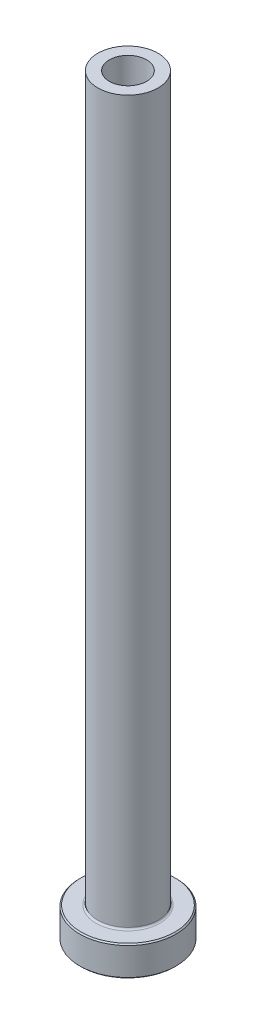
from build123d import *

# Parameters (mm, degrees)
FILLET1_R     = 0.3
CHAMFER1_SIZE = 0.2
CHAMFER3_SIZE = 0.5


with BuildPart() as part:
    # Sketch1 → Revolve1 (revolve)
    with BuildSketch(Plane.XY, mode=Mode.PRIVATE) as revolve1_sk:
        Polygon((-3.1, 125), (-5, 125), (-5, 5), (-8, 5), (-8, 0), (-3.35, 0), (-3.35, 68), (-3.1, 80), align=None)
    revolve(revolve1_sk.sketch.rotate(Axis((0, 92.187680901, 0), (0, -1, 0)), 270), axis=Axis((0, 92.187680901, 0), (0, -1, 0)))

    # Fillet1
    fillet1_edges = [part.edges().sort_by_distance(p)[0] for p in [
        (0, 5, -5),
    ]]
    fillet(fillet1_edges, radius=FILLET1_R)

    # Chamfer1
    chamfer1_edges = [part.edges().sort_by_distance(p)[0] for p in [
        (0, 0, -8),
        (0, 5, -8),
    ]]
    chamfer(chamfer1_edges, length=CHAMFER1_SIZE)

    # Chamfer3
    chamfer3_edges = [part.edges().sort_by_distance(p)[0] for p in [
        (0, 0, -3.35),
    ]]
    chamfer(chamfer3_edges, length=CHAMFER3_SIZE)


solid = part.part
